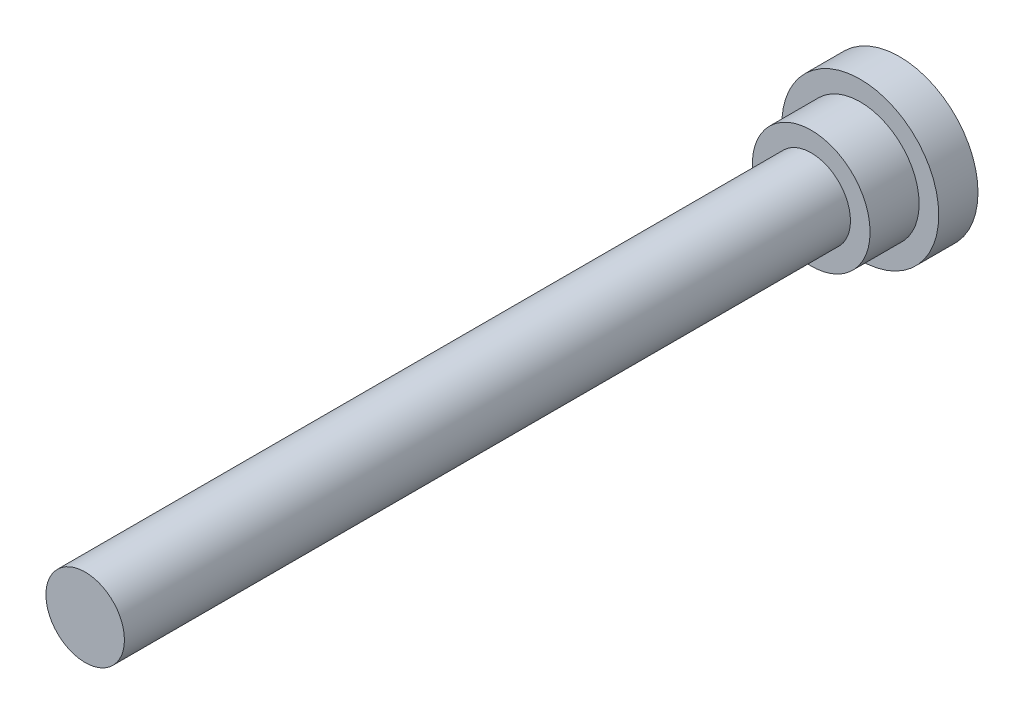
ISO-10303-21;
HEADER;
FILE_DESCRIPTION(('STEP AP214'),'2;1');
FILE_NAME('part.step','',(''),(''),'','','');
FILE_SCHEMA(('AUTOMOTIVE_DESIGN { 1 0 10303 214 1 1 1 1 }'));
ENDSEC;
DATA;
#1=APPLICATION_CONTEXT('core data for automotive mechanical design processes');
#2=APPLICATION_PROTOCOL_DEFINITION('international standard','automotive_design',2000,#1);
#3=PRODUCT_CONTEXT('',#1,'mechanical');
#4=PRODUCT('Part','Part','',(#3));
#5=PRODUCT_RELATED_PRODUCT_CATEGORY('part','',(#4));
#6=PRODUCT_DEFINITION_FORMATION('','',#4);
#7=PRODUCT_DEFINITION_CONTEXT('part definition',#1,'design');
#8=PRODUCT_DEFINITION('design','',#6,#7);
#9=PRODUCT_DEFINITION_SHAPE('','',#8);
#10=(LENGTH_UNIT() NAMED_UNIT(*) SI_UNIT(.MILLI.,.METRE.));
#11=(NAMED_UNIT(*) PLANE_ANGLE_UNIT() SI_UNIT($,.RADIAN.));
#12=(NAMED_UNIT(*) SI_UNIT($,.STERADIAN.) SOLID_ANGLE_UNIT());
#13=UNCERTAINTY_MEASURE_WITH_UNIT(LENGTH_MEASURE(1.E-05),#10,'distance_accuracy_value','');
#14=(GEOMETRIC_REPRESENTATION_CONTEXT(3) GLOBAL_UNCERTAINTY_ASSIGNED_CONTEXT((#13)) GLOBAL_UNIT_ASSIGNED_CONTEXT((#10,
#11,#12)) REPRESENTATION_CONTEXT('',''));
#15=CARTESIAN_POINT('',(0.,0.,0.));
#16=DIRECTION('',(0.,0.,1.));
#17=DIRECTION('',(1.,0.,0.));
#18=AXIS2_PLACEMENT_3D('',#15,#16,#17);
#19=CARTESIAN_POINT('',(0.,0.,83.));
#20=DIRECTION('',(0.,0.,1.));
#21=DIRECTION('',(1.,0.,0.));
#22=AXIS2_PLACEMENT_3D('',#19,#20,#21);
#23=PLANE('',#22);
#24=CARTESIAN_POINT('',(0.,0.,83.));
#25=DIRECTION('',(0.,0.,1.));
#26=DIRECTION('',(1.,0.,0.));
#27=AXIS2_PLACEMENT_3D('',#24,#25,#26);
#28=CIRCLE('',#27,4.);
#29=CARTESIAN_POINT('',(4.,0.,83.));
#30=VERTEX_POINT('',#29);
#31=EDGE_CURVE('E8',#30,#30,#28,.T.);
#32=ORIENTED_EDGE('',*,*,#31,.T.);
#33=EDGE_LOOP('',(#32));
#34=FACE_BOUND('',#33,.T.);
#35=ADVANCED_FACE('F12',(#34),#23,.T.);
#36=CARTESIAN_POINT('',(0.,0.,30.));
#37=DIRECTION('',(0.,0.,1.));
#38=DIRECTION('',(1.,0.,0.));
#39=AXIS2_PLACEMENT_3D('',#36,#37,#38);
#40=CYLINDRICAL_SURFACE('',#39,4.);
#41=CARTESIAN_POINT('',(0.,0.,9.));
#42=DIRECTION('',(0.,0.,1.));
#43=DIRECTION('',(1.,0.,0.));
#44=AXIS2_PLACEMENT_3D('',#41,#42,#43);
#45=CIRCLE('',#44,4.);
#46=CARTESIAN_POINT('',(4.,0.,9.));
#47=VERTEX_POINT('',#46);
#48=EDGE_CURVE('E18',#47,#47,#45,.T.);
#49=ORIENTED_EDGE('',*,*,#48,.T.);
#50=EDGE_LOOP('',(#49));
#51=FACE_BOUND('',#50,.T.);
#52=ORIENTED_EDGE('',*,*,#31,.F.);
#53=EDGE_LOOP('',(#52));
#54=FACE_BOUND('',#53,.T.);
#55=ADVANCED_FACE('F52',(#51,#54),#40,.T.);
#56=CARTESIAN_POINT('',(-4.,0.,9.));
#57=DIRECTION('',(0.,0.,1.));
#58=DIRECTION('',(1.,0.,0.));
#59=AXIS2_PLACEMENT_3D('',#56,#57,#58);
#60=PLANE('',#59);
#61=CARTESIAN_POINT('',(0.,0.,9.));
#62=DIRECTION('',(0.,0.,1.));
#63=DIRECTION('',(1.,0.,0.));
#64=AXIS2_PLACEMENT_3D('',#61,#62,#63);
#65=CIRCLE('',#64,6.);
#66=CARTESIAN_POINT('',(6.,0.,9.));
#67=VERTEX_POINT('',#66);
#68=EDGE_CURVE('E22',#67,#67,#65,.T.);
#69=ORIENTED_EDGE('',*,*,#68,.T.);
#70=EDGE_LOOP('',(#69));
#71=FACE_BOUND('',#70,.T.);
#72=ORIENTED_EDGE('',*,*,#48,.F.);
#73=EDGE_LOOP('',(#72));
#74=FACE_BOUND('',#73,.T.);
#75=ADVANCED_FACE('F57',(#71,#74),#60,.T.);
#76=CARTESIAN_POINT('',(0.,0.,30.));
#77=DIRECTION('',(0.,0.,1.));
#78=DIRECTION('',(1.,0.,0.));
#79=AXIS2_PLACEMENT_3D('',#76,#77,#78);
#80=CYLINDRICAL_SURFACE('',#79,6.);
#81=CARTESIAN_POINT('',(0.,0.,4.));
#82=DIRECTION('',(0.,0.,1.));
#83=DIRECTION('',(1.,0.,0.));
#84=AXIS2_PLACEMENT_3D('',#81,#82,#83);
#85=CIRCLE('',#84,6.);
#86=CARTESIAN_POINT('',(6.,0.,4.));
#87=VERTEX_POINT('',#86);
#88=EDGE_CURVE('E26',#87,#87,#85,.T.);
#89=ORIENTED_EDGE('',*,*,#88,.T.);
#90=EDGE_LOOP('',(#89));
#91=FACE_BOUND('',#90,.T.);
#92=ORIENTED_EDGE('',*,*,#68,.F.);
#93=EDGE_LOOP('',(#92));
#94=FACE_BOUND('',#93,.T.);
#95=ADVANCED_FACE('F62',(#91,#94),#80,.T.);
#96=CARTESIAN_POINT('',(-6.,0.,4.));
#97=DIRECTION('',(0.,0.,1.));
#98=DIRECTION('',(1.,0.,0.));
#99=AXIS2_PLACEMENT_3D('',#96,#97,#98);
#100=PLANE('',#99);
#101=CARTESIAN_POINT('',(0.,0.,4.));
#102=DIRECTION('',(0.,0.,1.));
#103=DIRECTION('',(1.,0.,0.));
#104=AXIS2_PLACEMENT_3D('',#101,#102,#103);
#105=CIRCLE('',#104,8.);
#106=CARTESIAN_POINT('',(8.,0.,4.));
#107=VERTEX_POINT('',#106);
#108=EDGE_CURVE('E31',#107,#107,#105,.T.);
#109=ORIENTED_EDGE('',*,*,#108,.T.);
#110=EDGE_LOOP('',(#109));
#111=FACE_BOUND('',#110,.T.);
#112=ORIENTED_EDGE('',*,*,#88,.F.);
#113=EDGE_LOOP('',(#112));
#114=FACE_BOUND('',#113,.T.);
#115=ADVANCED_FACE('F49',(#111,#114),#100,.T.);
#116=CARTESIAN_POINT('',(0.,0.,30.));
#117=DIRECTION('',(0.,0.,1.));
#118=DIRECTION('',(1.,0.,0.));
#119=AXIS2_PLACEMENT_3D('',#116,#117,#118);
#120=CYLINDRICAL_SURFACE('',#119,8.);
#121=CARTESIAN_POINT('',(0.,0.,0.));
#122=DIRECTION('',(0.,0.,1.));
#123=DIRECTION('',(1.,0.,0.));
#124=AXIS2_PLACEMENT_3D('',#121,#122,#123);
#125=CIRCLE('',#124,8.);
#126=CARTESIAN_POINT('',(8.,0.,0.));
#127=VERTEX_POINT('',#126);
#128=EDGE_CURVE('E34',#127,#127,#125,.T.);
#129=ORIENTED_EDGE('',*,*,#128,.T.);
#130=EDGE_LOOP('',(#129));
#131=FACE_BOUND('',#130,.T.);
#132=ORIENTED_EDGE('',*,*,#108,.F.);
#133=EDGE_LOOP('',(#132));
#134=FACE_BOUND('',#133,.T.);
#135=ADVANCED_FACE('F38',(#131,#134),#120,.T.);
#136=CARTESIAN_POINT('',(-8.,0.,0.));
#137=DIRECTION('',(0.,0.,-1.));
#138=DIRECTION('',(-1.,0.,0.));
#139=AXIS2_PLACEMENT_3D('',#136,#137,#138);
#140=PLANE('',#139);
#141=ORIENTED_EDGE('',*,*,#128,.F.);
#142=EDGE_LOOP('',(#141));
#143=FACE_BOUND('',#142,.T.);
#144=ADVANCED_FACE('F41',(#143),#140,.T.);
#145=CLOSED_SHELL('',(#35,#55,#75,#95,#115,#135,#144));
#146=MANIFOLD_SOLID_BREP('B1',#145);
#147=ADVANCED_BREP_SHAPE_REPRESENTATION('',(#18,#146),#14);
#148=SHAPE_DEFINITION_REPRESENTATION(#9,#147);
ENDSEC;
END-ISO-10303-21;
